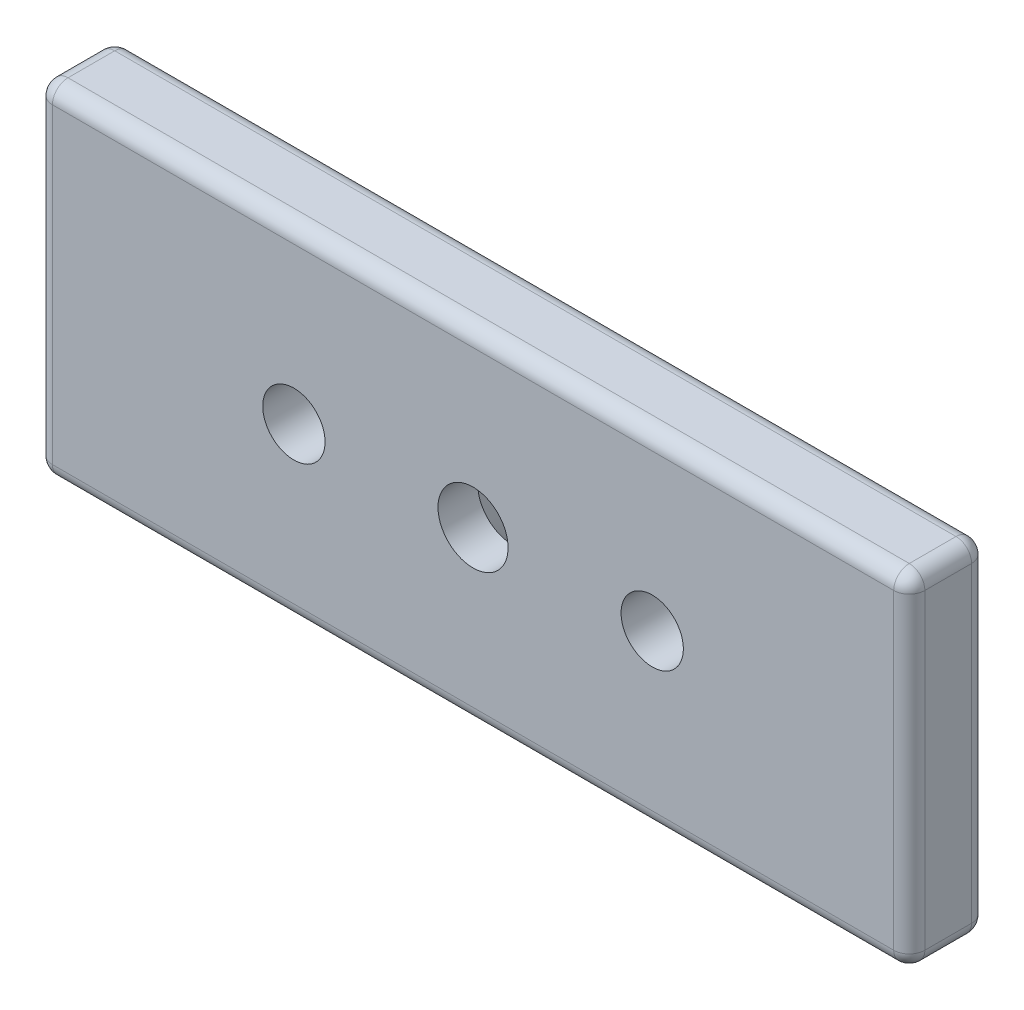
from build123d import *

# Parameters (mm, degrees)
SKETCH_BASE_W                                   = 56
SKETCH_BASE_H                                   = 22
BASE_EXTRUDE_DEPTH                              = 5
SKETCH2_R                                       = 2
MOUNTING_HOLES_DEPTH                            = 61.373835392
SMALL_EDGE_FILLET_R                             = 1
FRONT_BACK_EDGE_FILLET_R                        = 1
CSK_FOR_M4_FLAT_HEAD_MACHINE_SCREW1_D           = 4.5
CSK_FOR_M4_FLAT_HEAD_MACHINE_SCREW1_CSINK_D     = 9.4
CSK_FOR_M4_FLAT_HEAD_MACHINE_SCREW1_CSINK_ANGLE = 90


with BuildPart() as part:
    # Sketch-Base → Base-Extrude (new body)
    with BuildSketch(Plane.XY):
        with Locations((28, 11)):
            Rectangle(SKETCH_BASE_W, SKETCH_BASE_H)
    extrude(amount=-BASE_EXTRUDE_DEPTH)

    # Sketch2 → Mounting Holes (cut, through all)
    with BuildSketch(Plane.XY):
        with Locations((16.5, 11)):
            Circle(SKETCH2_R)
        with Locations((39.5, 11)):
            Circle(SKETCH2_R)
    extrude(amount=-MOUNTING_HOLES_DEPTH, mode=Mode.SUBTRACT)

    # Small Edge Fillet
    small_edge_fillet_edges = [part.edges().sort_by_distance(p)[0] for p in [
        (0, 22, -2.5),
        (56, 22, -2.5),
        (56, 0, -2.5),
        (0, 0, -2.5),
    ]]
    fillet(small_edge_fillet_edges, radius=SMALL_EDGE_FILLET_R)

    # Front-Back Edge Fillet
    front_back_edge_fillet_edges = [part.edges().sort_by_distance(p)[0] for p in [
        (28, 0, 0),
        (28, 0, -5),
        (0, 11, 0),
        (56, 11, 0),
        (28, 22, 0),
        (0.292893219, 0.292893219, 0),
        (0.292893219, 21.707106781, 0),
        (55.707106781, 21.707106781, 0),
        (55.707106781, 0.292893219, 0),
        (56, 11, -5),
        (0, 11, -5),
        (28, 22, -5),
        (0.292893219, 0.292893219, -5),
        (0.292893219, 21.707106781, -5),
        (55.707106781, 21.707106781, -5),
        (55.707106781, 0.292893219, -5),
    ]]
    fillet(front_back_edge_fillet_edges, radius=FRONT_BACK_EDGE_FILLET_R)

    # CSK for M4 Flat Head Machine Screw1 (through all)
    with Locations(Plane(origin=(0, 0, -5), x_dir=(-1, 0, 0), z_dir=(0, 0, -1))):
        with Locations((-28, 11)):
            CounterSinkHole(CSK_FOR_M4_FLAT_HEAD_MACHINE_SCREW1_D / 2, CSK_FOR_M4_FLAT_HEAD_MACHINE_SCREW1_CSINK_D / 2, counter_sink_angle=CSK_FOR_M4_FLAT_HEAD_MACHINE_SCREW1_CSINK_ANGLE)


solid = part.part
